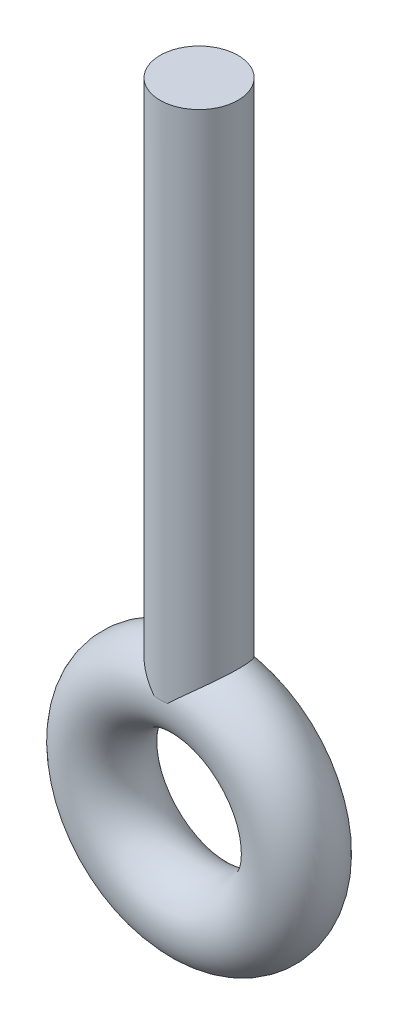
from build123d import *

# Parameters (mm, degrees)
SKETCH1_R           = 3
SKETCH2_R           = 3
BOSS_EXTRUDE1_DEPTH = 40


with BuildPart() as part:
    # Sketch1 → Revolve1 (revolve)
    with BuildSketch(Plane(origin=(0, 0, 0), x_dir=(1, 0, 0), z_dir=(0, 1, 0))):
        with Locations((-7.5, 0)):
            Circle(SKETCH1_R)
    revolve(axis=Axis((0, 0, -26.095080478), (0, 0, 1)))

    # Sketch2 → Boss-Extrude1 (add)
    with BuildSketch(Plane(origin=(0, 8, 0), x_dir=(1, 0, 0), z_dir=(0, 1, 0))):
        with Locations(Location((0, 0, 0), (0, 0, 99.917048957))):
            Circle(SKETCH2_R)
    extrude(amount=BOSS_EXTRUDE1_DEPTH)


solid = part.part
